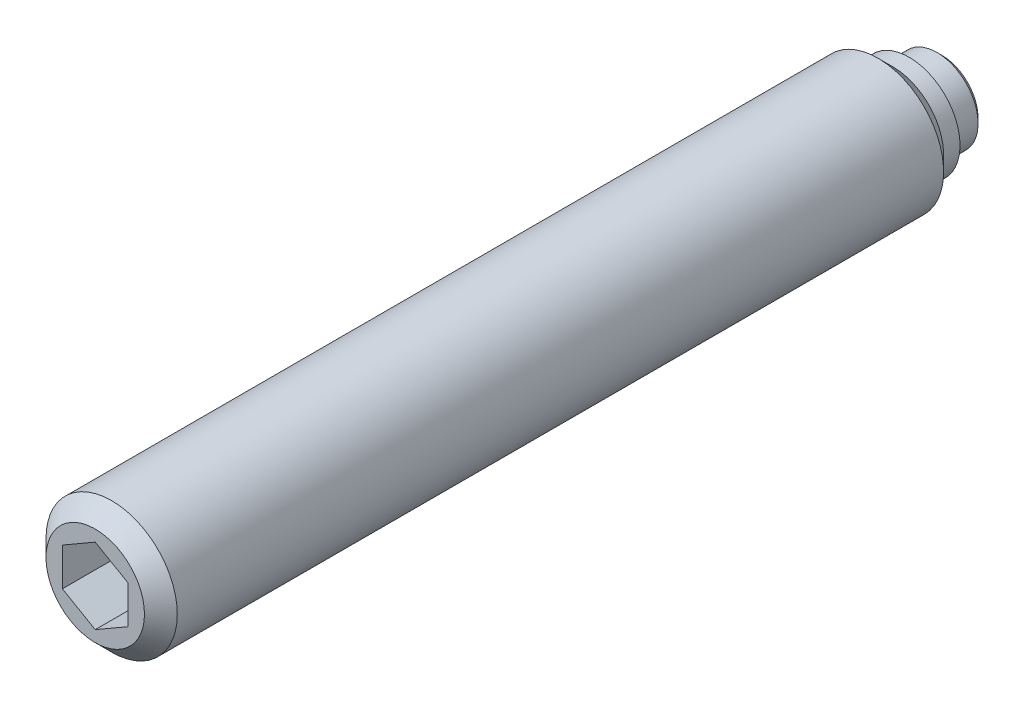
ISO-10303-21;
HEADER;
FILE_DESCRIPTION(('STEP AP214'),'2;1');
FILE_NAME('part.step','',(''),(''),'','','');
FILE_SCHEMA(('AUTOMOTIVE_DESIGN { 1 0 10303 214 1 1 1 1 }'));
ENDSEC;
DATA;
#1=APPLICATION_CONTEXT('core data for automotive mechanical design processes');
#2=APPLICATION_PROTOCOL_DEFINITION('international standard','automotive_design',2000,#1);
#3=PRODUCT_CONTEXT('',#1,'mechanical');
#4=PRODUCT('Part','Part','',(#3));
#5=PRODUCT_RELATED_PRODUCT_CATEGORY('part','',(#4));
#6=PRODUCT_DEFINITION_FORMATION('','',#4);
#7=PRODUCT_DEFINITION_CONTEXT('part definition',#1,'design');
#8=PRODUCT_DEFINITION('design','',#6,#7);
#9=PRODUCT_DEFINITION_SHAPE('','',#8);
#10=(LENGTH_UNIT() NAMED_UNIT(*) SI_UNIT(.MILLI.,.METRE.));
#11=(NAMED_UNIT(*) PLANE_ANGLE_UNIT() SI_UNIT($,.RADIAN.));
#12=(NAMED_UNIT(*) SI_UNIT($,.STERADIAN.) SOLID_ANGLE_UNIT());
#13=UNCERTAINTY_MEASURE_WITH_UNIT(LENGTH_MEASURE(1.E-05),#10,'distance_accuracy_value','');
#14=(GEOMETRIC_REPRESENTATION_CONTEXT(3) GLOBAL_UNCERTAINTY_ASSIGNED_CONTEXT((#13)) GLOBAL_UNIT_ASSIGNED_CONTEXT((#10,
#11,#12)) REPRESENTATION_CONTEXT('',''));
#15=CARTESIAN_POINT('',(0.,0.,0.));
#16=DIRECTION('',(0.,0.,1.));
#17=DIRECTION('',(1.,0.,0.));
#18=AXIS2_PLACEMENT_3D('',#15,#16,#17);
#19=CARTESIAN_POINT('',(0.,0.,0.));
#20=DIRECTION('',(0.,0.,-1.));
#21=DIRECTION('',(-1.,0.,0.));
#22=AXIS2_PLACEMENT_3D('',#19,#20,#21);
#23=CYLINDRICAL_SURFACE('',#22,2.5);
#24=CARTESIAN_POINT('',(0.,0.,0.3));
#25=DIRECTION('',(0.,0.,-1.));
#26=DIRECTION('',(-1.,0.,0.));
#27=AXIS2_PLACEMENT_3D('',#24,#25,#26);
#28=CIRCLE('',#27,2.5);
#29=CARTESIAN_POINT('',(-2.5,0.,0.3));
#30=VERTEX_POINT('',#29);
#31=EDGE_CURVE('E133',#30,#30,#28,.T.);
#32=ORIENTED_EDGE('',*,*,#31,.F.);
#33=EDGE_LOOP('',(#32));
#34=FACE_BOUND('',#33,.T.);
#35=CARTESIAN_POINT('',(0.,0.,2.));
#36=DIRECTION('',(0.,0.,-1.));
#37=DIRECTION('',(-1.,0.,0.));
#38=AXIS2_PLACEMENT_3D('',#35,#36,#37);
#39=CIRCLE('',#38,2.5);
#40=CARTESIAN_POINT('',(-2.5,0.,2.));
#41=VERTEX_POINT('',#40);
#42=EDGE_CURVE('E127',#41,#41,#39,.T.);
#43=ORIENTED_EDGE('',*,*,#42,.T.);
#44=EDGE_LOOP('',(#43));
#45=FACE_BOUND('',#44,.T.);
#46=ADVANCED_FACE('F14',(#34,#45),#23,.T.);
#47=CARTESIAN_POINT('',(0.,0.,0.3));
#48=DIRECTION('',(0.,0.,1.));
#49=DIRECTION('',(1.,0.,0.));
#50=AXIS2_PLACEMENT_3D('',#47,#48,#49);
#51=CONICAL_SURFACE('',#50,2.5,0.785398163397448);
#52=CARTESIAN_POINT('',(0.,0.,0.));
#53=DIRECTION('',(0.,0.,-1.));
#54=DIRECTION('',(-1.,0.,0.));
#55=AXIS2_PLACEMENT_3D('',#52,#53,#54);
#56=CIRCLE('',#55,2.2);
#57=CARTESIAN_POINT('',(-2.2,0.,0.));
#58=VERTEX_POINT('',#57);
#59=EDGE_CURVE('E130',#58,#58,#56,.T.);
#60=ORIENTED_EDGE('',*,*,#59,.F.);
#61=EDGE_LOOP('',(#60));
#62=FACE_BOUND('',#61,.T.);
#63=ORIENTED_EDGE('',*,*,#31,.T.);
#64=EDGE_LOOP('',(#63));
#65=FACE_BOUND('',#64,.T.);
#66=ADVANCED_FACE('F159',(#62,#65),#51,.T.);
#67=CARTESIAN_POINT('',(0.,2.2,0.));
#68=DIRECTION('',(0.,0.,1.));
#69=DIRECTION('',(1.,0.,0.));
#70=AXIS2_PLACEMENT_3D('',#67,#68,#69);
#71=PLANE('',#70);
#72=ORIENTED_EDGE('',*,*,#59,.T.);
#73=EDGE_LOOP('',(#72));
#74=FACE_BOUND('',#73,.T.);
#75=ADVANCED_FACE('F165',(#74),#71,.F.);
#76=CARTESIAN_POINT('',(0.,0.,2.));
#77=DIRECTION('',(0.,0.,-1.));
#78=DIRECTION('',(-1.,0.,0.));
#79=AXIS2_PLACEMENT_3D('',#76,#77,#78);
#80=CYLINDRICAL_SURFACE('',#79,4.);
#81=CARTESIAN_POINT('',(0.,0.,3.9));
#82=DIRECTION('',(0.,0.,-1.));
#83=DIRECTION('',(-1.,0.,0.));
#84=AXIS2_PLACEMENT_3D('',#81,#82,#83);
#85=CIRCLE('',#84,4.);
#86=CARTESIAN_POINT('',(-4.,0.,3.9));
#87=VERTEX_POINT('',#86);
#88=EDGE_CURVE('E9',#87,#87,#85,.T.);
#89=ORIENTED_EDGE('',*,*,#88,.F.);
#90=EDGE_LOOP('',(#89));
#91=FACE_BOUND('',#90,.T.);
#92=CARTESIAN_POINT('',(0.,0.,50.6));
#93=DIRECTION('',(0.,0.,1.));
#94=DIRECTION('',(1.,0.,0.));
#95=AXIS2_PLACEMENT_3D('',#92,#93,#94);
#96=CIRCLE('',#95,4.);
#97=CARTESIAN_POINT('',(4.,0.,50.6));
#98=VERTEX_POINT('',#97);
#99=EDGE_CURVE('E124',#98,#98,#96,.T.);
#100=ORIENTED_EDGE('',*,*,#99,.F.);
#101=EDGE_LOOP('',(#100));
#102=FACE_BOUND('',#101,.T.);
#103=ADVANCED_FACE('F16',(#91,#102),#80,.T.);
#104=CARTESIAN_POINT('',(0.,3.1,2.));
#105=DIRECTION('',(0.,0.,1.));
#106=DIRECTION('',(1.,0.,0.));
#107=AXIS2_PLACEMENT_3D('',#104,#105,#106);
#108=PLANE('',#107);
#109=CARTESIAN_POINT('',(0.,0.,2.));
#110=DIRECTION('',(0.,0.,-1.));
#111=DIRECTION('',(-1.,0.,0.));
#112=AXIS2_PLACEMENT_3D('',#109,#110,#111);
#113=CIRCLE('',#112,3.1);
#114=CARTESIAN_POINT('',(-3.1,0.,2.));
#115=VERTEX_POINT('',#114);
#116=EDGE_CURVE('E136',#115,#115,#113,.T.);
#117=ORIENTED_EDGE('',*,*,#116,.T.);
#118=EDGE_LOOP('',(#117));
#119=FACE_BOUND('',#118,.T.);
#120=ORIENTED_EDGE('',*,*,#42,.F.);
#121=EDGE_LOOP('',(#120));
#122=FACE_BOUND('',#121,.T.);
#123=ADVANCED_FACE('F156',(#119,#122),#108,.F.);
#124=CARTESIAN_POINT('',(0.,0.,2.));
#125=DIRECTION('',(0.,0.,-1.));
#126=DIRECTION('',(-1.,0.,0.));
#127=AXIS2_PLACEMENT_3D('',#124,#125,#126);
#128=CYLINDRICAL_SURFACE('',#127,3.1);
#129=CARTESIAN_POINT('',(0.,0.,3.));
#130=DIRECTION('',(0.,0.,-1.));
#131=DIRECTION('',(-1.,0.,0.));
#132=AXIS2_PLACEMENT_3D('',#129,#130,#131);
#133=CIRCLE('',#132,3.1);
#134=CARTESIAN_POINT('',(-3.1,0.,3.));
#135=VERTEX_POINT('',#134);
#136=EDGE_CURVE('E22',#135,#135,#133,.T.);
#137=ORIENTED_EDGE('',*,*,#136,.T.);
#138=EDGE_LOOP('',(#137));
#139=FACE_BOUND('',#138,.T.);
#140=ORIENTED_EDGE('',*,*,#116,.F.);
#141=EDGE_LOOP('',(#140));
#142=FACE_BOUND('',#141,.T.);
#143=ADVANCED_FACE('F141',(#139,#142),#128,.T.);
#144=CARTESIAN_POINT('',(0.,0.,3.9));
#145=DIRECTION('',(0.,0.,1.));
#146=DIRECTION('',(1.,0.,0.));
#147=AXIS2_PLACEMENT_3D('',#144,#145,#146);
#148=CONICAL_SURFACE('',#147,4.,0.78539816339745);
#149=ORIENTED_EDGE('',*,*,#88,.T.);
#150=EDGE_LOOP('',(#149));
#151=FACE_BOUND('',#150,.T.);
#152=ORIENTED_EDGE('',*,*,#136,.F.);
#153=EDGE_LOOP('',(#152));
#154=FACE_BOUND('',#153,.T.);
#155=ADVANCED_FACE('F144',(#151,#154),#148,.T.);
#156=CARTESIAN_POINT('',(0.,-3.,51.6));
#157=DIRECTION('',(0.,0.,1.));
#158=DIRECTION('',(1.,0.,0.));
#159=AXIS2_PLACEMENT_3D('',#156,#157,#158);
#160=PLANE('',#159);
#161=DIRECTION('',(0.866025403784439,-0.5,0.));
#162=VECTOR('',#161,1.);
#163=CARTESIAN_POINT('',(-2.,-1.15470053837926,51.6));
#164=LINE('',#163,#162);
#165=CARTESIAN_POINT('',(-2.,-1.15470053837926,51.6));
#166=VERTEX_POINT('',#165);
#167=CARTESIAN_POINT('',(0.,-2.30940107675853,51.6));
#168=VERTEX_POINT('',#167);
#169=EDGE_CURVE('E29',#166,#168,#164,.T.);
#170=ORIENTED_EDGE('',*,*,#169,.F.);
#171=DIRECTION('',(0.,-1.,0.));
#172=VECTOR('',#171,1.);
#173=CARTESIAN_POINT('',(-2.,1.15470053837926,51.6));
#174=LINE('',#173,#172);
#175=CARTESIAN_POINT('',(-2.,1.15470053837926,51.6));
#176=VERTEX_POINT('',#175);
#177=EDGE_CURVE('E112',#176,#166,#174,.T.);
#178=ORIENTED_EDGE('',*,*,#177,.F.);
#179=DIRECTION('',(-0.866025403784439,-0.5,0.));
#180=VECTOR('',#179,1.);
#181=CARTESIAN_POINT('',(0.,2.30940107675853,51.6));
#182=LINE('',#181,#180);
#183=CARTESIAN_POINT('',(0.,2.30940107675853,51.6));
#184=VERTEX_POINT('',#183);
#185=EDGE_CURVE('E110',#184,#176,#182,.T.);
#186=ORIENTED_EDGE('',*,*,#185,.F.);
#187=DIRECTION('',(-0.866025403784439,0.5,0.));
#188=VECTOR('',#187,1.);
#189=CARTESIAN_POINT('',(2.,1.15470053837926,51.6));
#190=LINE('',#189,#188);
#191=CARTESIAN_POINT('',(2.,1.15470053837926,51.6));
#192=VERTEX_POINT('',#191);
#193=EDGE_CURVE('E77',#192,#184,#190,.T.);
#194=ORIENTED_EDGE('',*,*,#193,.F.);
#195=DIRECTION('',(0.,1.,0.));
#196=VECTOR('',#195,1.);
#197=CARTESIAN_POINT('',(2.,-1.15470053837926,51.6));
#198=LINE('',#197,#196);
#199=CARTESIAN_POINT('',(2.,-1.15470053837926,51.6));
#200=VERTEX_POINT('',#199);
#201=EDGE_CURVE('E106',#200,#192,#198,.T.);
#202=ORIENTED_EDGE('',*,*,#201,.F.);
#203=DIRECTION('',(0.866025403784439,0.5,0.));
#204=VECTOR('',#203,1.);
#205=CARTESIAN_POINT('',(0.,-2.30940107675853,51.6));
#206=LINE('',#205,#204);
#207=EDGE_CURVE('E103',#168,#200,#206,.T.);
#208=ORIENTED_EDGE('',*,*,#207,.F.);
#209=EDGE_LOOP('',(#170,#178,#186,#194,#202,#208));
#210=FACE_BOUND('',#209,.T.);
#211=CARTESIAN_POINT('',(0.,0.,51.6));
#212=DIRECTION('',(0.,0.,1.));
#213=DIRECTION('',(1.,0.,0.));
#214=AXIS2_PLACEMENT_3D('',#211,#212,#213);
#215=CIRCLE('',#214,3.);
#216=CARTESIAN_POINT('',(3.,0.,51.6));
#217=VERTEX_POINT('',#216);
#218=EDGE_CURVE('E116',#217,#217,#215,.T.);
#219=ORIENTED_EDGE('',*,*,#218,.T.);
#220=EDGE_LOOP('',(#219));
#221=FACE_BOUND('',#220,.T.);
#222=ADVANCED_FACE('F146',(#210,#221),#160,.T.);
#223=CARTESIAN_POINT('',(0.,0.,51.6));
#224=DIRECTION('',(0.,0.,-1.));
#225=DIRECTION('',(-1.,0.,0.));
#226=AXIS2_PLACEMENT_3D('',#223,#224,#225);
#227=CONICAL_SURFACE('',#226,3.,0.785398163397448);
#228=ORIENTED_EDGE('',*,*,#99,.T.);
#229=EDGE_LOOP('',(#228));
#230=FACE_BOUND('',#229,.T.);
#231=ORIENTED_EDGE('',*,*,#218,.F.);
#232=EDGE_LOOP('',(#231));
#233=FACE_BOUND('',#232,.T.);
#234=ADVANCED_FACE('F153',(#230,#233),#227,.T.);
#235=CARTESIAN_POINT('',(-2.,-1.15470053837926,46.6));
#236=DIRECTION('',(-0.5,-0.866025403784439,0.));
#237=DIRECTION('',(0.866025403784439,-0.5,0.));
#238=AXIS2_PLACEMENT_3D('',#235,#236,#237);
#239=PLANE('',#238);
#240=ORIENTED_EDGE('',*,*,#169,.T.);
#241=DIRECTION('',(0.,0.,1.));
#242=VECTOR('',#241,1.);
#243=CARTESIAN_POINT('',(0.,-2.30940107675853,46.6));
#244=LINE('',#243,#242);
#245=CARTESIAN_POINT('',(0.,-2.30940107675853,46.6));
#246=VERTEX_POINT('',#245);
#247=EDGE_CURVE('E59',#246,#168,#244,.T.);
#248=ORIENTED_EDGE('',*,*,#247,.F.);
#249=DIRECTION('',(0.866025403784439,-0.5,0.));
#250=VECTOR('',#249,1.);
#251=CARTESIAN_POINT('',(-2.,-1.15470053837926,46.6));
#252=LINE('',#251,#250);
#253=CARTESIAN_POINT('',(-2.,-1.15470053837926,46.6));
#254=VERTEX_POINT('',#253);
#255=EDGE_CURVE('E114',#254,#246,#252,.T.);
#256=ORIENTED_EDGE('',*,*,#255,.F.);
#257=DIRECTION('',(0.,0.,1.));
#258=VECTOR('',#257,1.);
#259=CARTESIAN_POINT('',(-2.,-1.15470053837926,46.6));
#260=LINE('',#259,#258);
#261=EDGE_CURVE('E37',#254,#166,#260,.T.);
#262=ORIENTED_EDGE('',*,*,#261,.T.);
#263=EDGE_LOOP('',(#240,#248,#256,#262));
#264=FACE_BOUND('',#263,.T.);
#265=ADVANCED_FACE('F191',(#264),#239,.F.);
#266=CARTESIAN_POINT('',(-2.,1.15470053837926,46.6));
#267=DIRECTION('',(-1.,0.,0.));
#268=DIRECTION('',(0.,0.,1.));
#269=AXIS2_PLACEMENT_3D('',#266,#267,#268);
#270=PLANE('',#269);
#271=ORIENTED_EDGE('',*,*,#177,.T.);
#272=ORIENTED_EDGE('',*,*,#261,.F.);
#273=DIRECTION('',(0.,-1.,0.));
#274=VECTOR('',#273,1.);
#275=CARTESIAN_POINT('',(-2.,1.15470053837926,46.6));
#276=LINE('',#275,#274);
#277=CARTESIAN_POINT('',(-2.,1.15470053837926,46.6));
#278=VERTEX_POINT('',#277);
#279=EDGE_CURVE('E89',#278,#254,#276,.T.);
#280=ORIENTED_EDGE('',*,*,#279,.F.);
#281=DIRECTION('',(0.,0.,1.));
#282=VECTOR('',#281,1.);
#283=CARTESIAN_POINT('',(-2.,1.15470053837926,46.6));
#284=LINE('',#283,#282);
#285=EDGE_CURVE('E81',#278,#176,#284,.T.);
#286=ORIENTED_EDGE('',*,*,#285,.T.);
#287=EDGE_LOOP('',(#271,#272,#280,#286));
#288=FACE_BOUND('',#287,.T.);
#289=ADVANCED_FACE('F198',(#288),#270,.F.);
#290=CARTESIAN_POINT('',(0.,2.30940107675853,46.6));
#291=DIRECTION('',(-0.5,0.866025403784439,0.));
#292=DIRECTION('',(-0.866025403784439,-0.5,0.));
#293=AXIS2_PLACEMENT_3D('',#290,#291,#292);
#294=PLANE('',#293);
#295=ORIENTED_EDGE('',*,*,#185,.T.);
#296=ORIENTED_EDGE('',*,*,#285,.F.);
#297=DIRECTION('',(-0.866025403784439,-0.5,0.));
#298=VECTOR('',#297,1.);
#299=CARTESIAN_POINT('',(0.,2.30940107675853,46.6));
#300=LINE('',#299,#298);
#301=CARTESIAN_POINT('',(0.,2.30940107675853,46.6));
#302=VERTEX_POINT('',#301);
#303=EDGE_CURVE('E85',#302,#278,#300,.T.);
#304=ORIENTED_EDGE('',*,*,#303,.F.);
#305=DIRECTION('',(0.,0.,1.));
#306=VECTOR('',#305,1.);
#307=CARTESIAN_POINT('',(0.,2.30940107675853,46.6));
#308=LINE('',#307,#306);
#309=EDGE_CURVE('E70',#302,#184,#308,.T.);
#310=ORIENTED_EDGE('',*,*,#309,.T.);
#311=EDGE_LOOP('',(#295,#296,#304,#310));
#312=FACE_BOUND('',#311,.T.);
#313=ADVANCED_FACE('F86',(#312),#294,.F.);
#314=CARTESIAN_POINT('',(2.,1.15470053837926,46.6));
#315=DIRECTION('',(0.5,0.866025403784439,0.));
#316=DIRECTION('',(-0.866025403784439,0.5,0.));
#317=AXIS2_PLACEMENT_3D('',#314,#315,#316);
#318=PLANE('',#317);
#319=ORIENTED_EDGE('',*,*,#193,.T.);
#320=ORIENTED_EDGE('',*,*,#309,.F.);
#321=DIRECTION('',(-0.866025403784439,0.5,0.));
#322=VECTOR('',#321,1.);
#323=CARTESIAN_POINT('',(2.,1.15470053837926,46.6));
#324=LINE('',#323,#322);
#325=CARTESIAN_POINT('',(2.,1.15470053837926,46.6));
#326=VERTEX_POINT('',#325);
#327=EDGE_CURVE('E74',#326,#302,#324,.T.);
#328=ORIENTED_EDGE('',*,*,#327,.F.);
#329=DIRECTION('',(0.,0.,1.));
#330=VECTOR('',#329,1.);
#331=CARTESIAN_POINT('',(2.,1.15470053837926,46.6));
#332=LINE('',#331,#330);
#333=EDGE_CURVE('E82',#326,#192,#332,.T.);
#334=ORIENTED_EDGE('',*,*,#333,.T.);
#335=EDGE_LOOP('',(#319,#320,#328,#334));
#336=FACE_BOUND('',#335,.T.);
#337=ADVANCED_FACE('F72',(#336),#318,.F.);
#338=CARTESIAN_POINT('',(2.,-1.15470053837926,46.6));
#339=DIRECTION('',(1.,0.,0.));
#340=DIRECTION('',(0.,0.,-1.));
#341=AXIS2_PLACEMENT_3D('',#338,#339,#340);
#342=PLANE('',#341);
#343=ORIENTED_EDGE('',*,*,#201,.T.);
#344=ORIENTED_EDGE('',*,*,#333,.F.);
#345=DIRECTION('',(0.,1.,0.));
#346=VECTOR('',#345,1.);
#347=CARTESIAN_POINT('',(2.,-1.15470053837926,46.6));
#348=LINE('',#347,#346);
#349=CARTESIAN_POINT('',(2.,-1.15470053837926,46.6));
#350=VERTEX_POINT('',#349);
#351=EDGE_CURVE('E95',#350,#326,#348,.T.);
#352=ORIENTED_EDGE('',*,*,#351,.F.);
#353=DIRECTION('',(0.,0.,1.));
#354=VECTOR('',#353,1.);
#355=CARTESIAN_POINT('',(2.,-1.15470053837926,46.6));
#356=LINE('',#355,#354);
#357=EDGE_CURVE('E119',#350,#200,#356,.T.);
#358=ORIENTED_EDGE('',*,*,#357,.T.);
#359=EDGE_LOOP('',(#343,#344,#352,#358));
#360=FACE_BOUND('',#359,.T.);
#361=ADVANCED_FACE('F204',(#360),#342,.F.);
#362=CARTESIAN_POINT('',(0.,-2.30940107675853,46.6));
#363=DIRECTION('',(0.5,-0.866025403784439,0.));
#364=DIRECTION('',(0.866025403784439,0.5,0.));
#365=AXIS2_PLACEMENT_3D('',#362,#363,#364);
#366=PLANE('',#365);
#367=ORIENTED_EDGE('',*,*,#207,.T.);
#368=ORIENTED_EDGE('',*,*,#357,.F.);
#369=DIRECTION('',(0.866025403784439,0.5,0.));
#370=VECTOR('',#369,1.);
#371=CARTESIAN_POINT('',(0.,-2.30940107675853,46.6));
#372=LINE('',#371,#370);
#373=EDGE_CURVE('E97',#246,#350,#372,.T.);
#374=ORIENTED_EDGE('',*,*,#373,.F.);
#375=ORIENTED_EDGE('',*,*,#247,.T.);
#376=EDGE_LOOP('',(#367,#368,#374,#375));
#377=FACE_BOUND('',#376,.T.);
#378=ADVANCED_FACE('F201',(#377),#366,.F.);
#379=CARTESIAN_POINT('',(0.,0.,46.6));
#380=DIRECTION('',(0.,0.,1.));
#381=DIRECTION('',(1.,0.,0.));
#382=AXIS2_PLACEMENT_3D('',#379,#380,#381);
#383=PLANE('',#382);
#384=ORIENTED_EDGE('',*,*,#255,.T.);
#385=ORIENTED_EDGE('',*,*,#373,.T.);
#386=ORIENTED_EDGE('',*,*,#351,.T.);
#387=ORIENTED_EDGE('',*,*,#327,.T.);
#388=ORIENTED_EDGE('',*,*,#303,.T.);
#389=ORIENTED_EDGE('',*,*,#279,.T.);
#390=EDGE_LOOP('',(#384,#385,#386,#387,#388,#389));
#391=FACE_BOUND('',#390,.T.);
#392=ADVANCED_FACE('F92',(#391),#383,.T.);
#393=CLOSED_SHELL('',(#46,#66,#75,#103,#123,#143,#155,#222,#234,#265,#289,#313,#337,#361,#378,#392));
#394=MANIFOLD_SOLID_BREP('B1',#393);
#395=ADVANCED_BREP_SHAPE_REPRESENTATION('',(#18,#394),#14);
#396=SHAPE_DEFINITION_REPRESENTATION(#9,#395);
ENDSEC;
END-ISO-10303-21;
